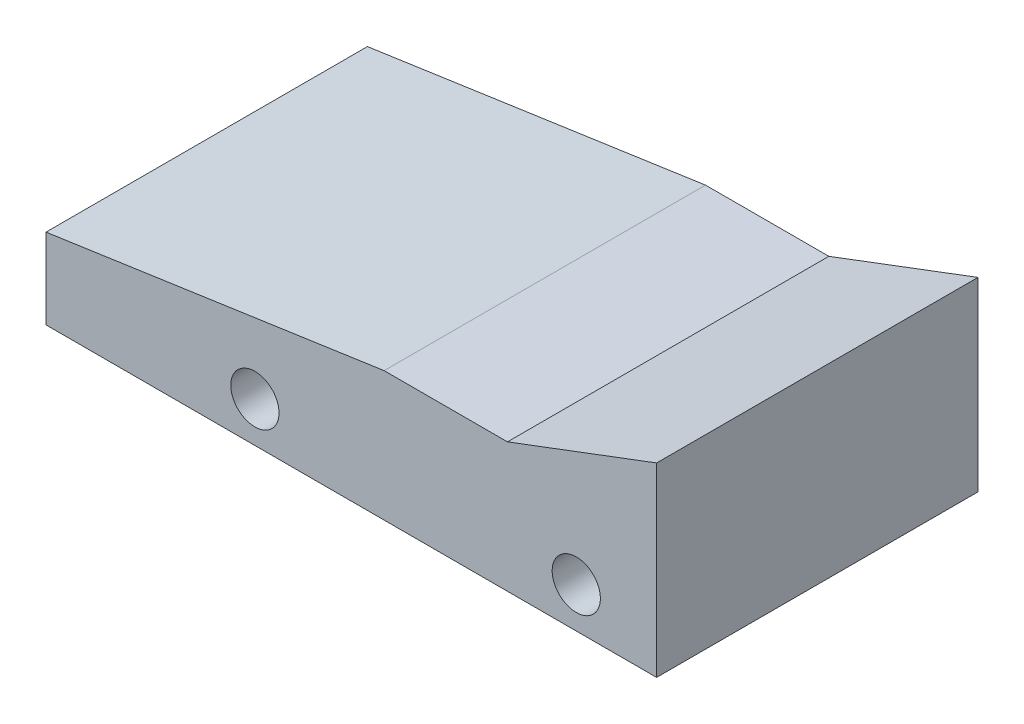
from build123d import *

# Parameters (mm, degrees)
SKETCH1_R           = 38.1
BOSS_EXTRUDE1_DEPTH = 508


with BuildPart() as part:
    # Sketch1 → Boss-Extrude1 (new body)
    with BuildSketch(Plane.XY):
        Polygon((-34.46885119, -13.65324625), (930.73114881, -13.65324625), (930.73114881, 279.977592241), (694.989051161, 190.95790516), (499.993546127, 190.95790516), (-34.46885119, 113.34675375), align=None)
        with Locations((295.73114881, 49.84675375)):
            Circle(SKETCH1_R, mode=Mode.SUBTRACT)
        with Locations((803.73114881, 49.84675375)):
            Circle(SKETCH1_R, mode=Mode.SUBTRACT)
    extrude(amount=BOSS_EXTRUDE1_DEPTH)


solid = part.part
